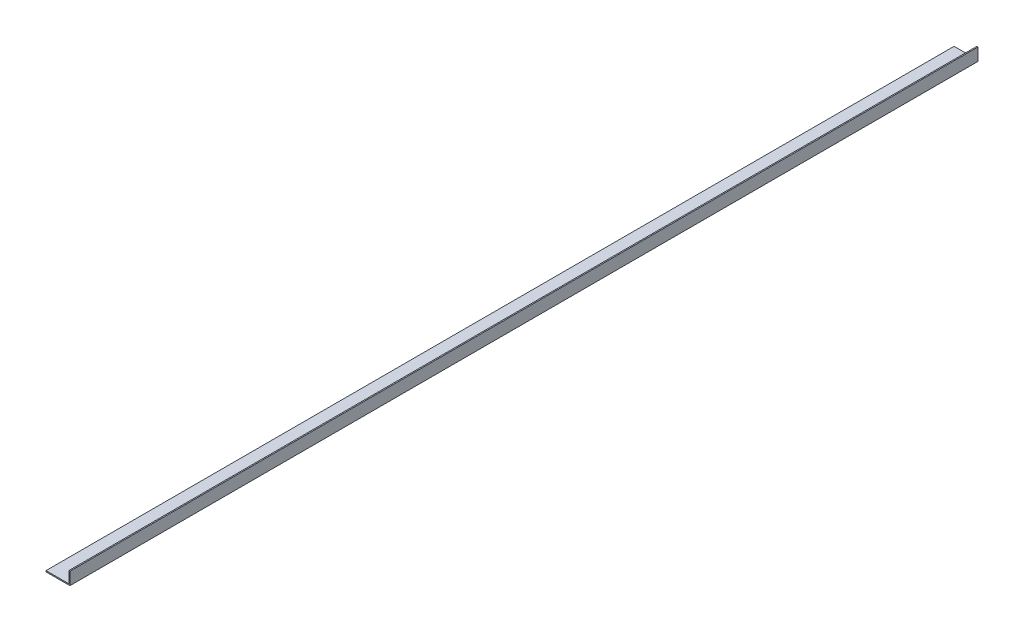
from build123d import *

# Parameters (mm, degrees)
BASE_EXTRUSION_DEPTH = 1196.564065


with BuildPart() as part:
    # Esquisse1 → Base-Extrusion (new body)
    with BuildSketch(Plane.XY):
        Polygon((16, 3938.852921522), (47.5, 3938.852921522), (47.5, 3955.352921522), (46, 3955.352921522), (46, 3940.352921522), (16, 3940.352921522), align=None)
    extrude(amount=-BASE_EXTRUSION_DEPTH)


solid = part.part
